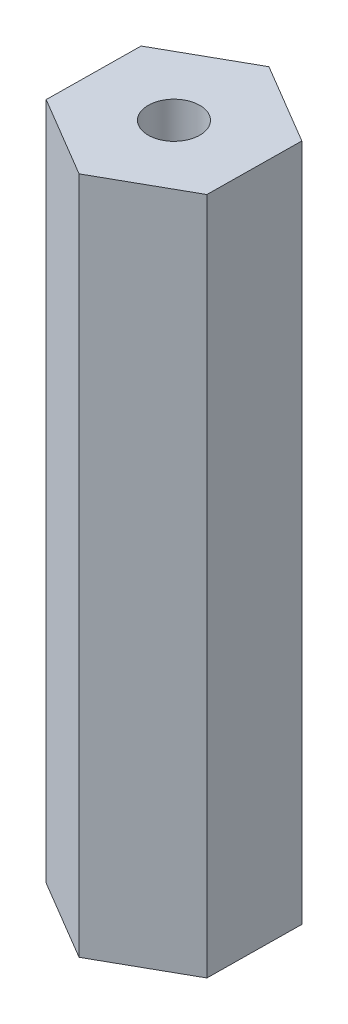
ISO-10303-21;
HEADER;
FILE_DESCRIPTION(('STEP AP214'),'2;1');
FILE_NAME('part.step','',(''),(''),'','','');
FILE_SCHEMA(('AUTOMOTIVE_DESIGN { 1 0 10303 214 1 1 1 1 }'));
ENDSEC;
DATA;
#1=APPLICATION_CONTEXT('core data for automotive mechanical design processes');
#2=APPLICATION_PROTOCOL_DEFINITION('international standard','automotive_design',2000,#1);
#3=PRODUCT_CONTEXT('',#1,'mechanical');
#4=PRODUCT('Part','Part','',(#3));
#5=PRODUCT_RELATED_PRODUCT_CATEGORY('part','',(#4));
#6=PRODUCT_DEFINITION_FORMATION('','',#4);
#7=PRODUCT_DEFINITION_CONTEXT('part definition',#1,'design');
#8=PRODUCT_DEFINITION('design','',#6,#7);
#9=PRODUCT_DEFINITION_SHAPE('','',#8);
#10=(LENGTH_UNIT() NAMED_UNIT(*) SI_UNIT(.MILLI.,.METRE.));
#11=(NAMED_UNIT(*) PLANE_ANGLE_UNIT() SI_UNIT($,.RADIAN.));
#12=(NAMED_UNIT(*) SI_UNIT($,.STERADIAN.) SOLID_ANGLE_UNIT());
#13=UNCERTAINTY_MEASURE_WITH_UNIT(LENGTH_MEASURE(1.E-05),#10,'distance_accuracy_value','');
#14=(GEOMETRIC_REPRESENTATION_CONTEXT(3) GLOBAL_UNCERTAINTY_ASSIGNED_CONTEXT((#13)) GLOBAL_UNIT_ASSIGNED_CONTEXT((#10,
#11,#12)) REPRESENTATION_CONTEXT('',''));
#15=CARTESIAN_POINT('',(0.,0.,0.));
#16=DIRECTION('',(0.,0.,1.));
#17=DIRECTION('',(1.,0.,0.));
#18=AXIS2_PLACEMENT_3D('',#15,#16,#17);
#19=CARTESIAN_POINT('',(0.,52.9971,0.));
#20=DIRECTION('',(0.,1.,0.));
#21=DIRECTION('',(0.,0.,1.));
#22=AXIS2_PLACEMENT_3D('',#19,#20,#21);
#23=PLANE('',#22);
#24=DIRECTION('',(0.87171232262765,0.,-0.490017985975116));
#25=VECTOR('',#24,1.);
#26=CARTESIAN_POINT('',(-0.0842350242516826,52.9971,7.3318645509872));
#27=LINE('',#26,#25);
#28=CARTESIAN_POINT('',(-0.0842350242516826,52.9971,7.3318645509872));
#29=VERTEX_POINT('',#28);
#30=CARTESIAN_POINT('',(6.30746344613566,52.9971,3.73888194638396));
#31=VERTEX_POINT('',#30);
#32=EDGE_CURVE('E129',#29,#31,#27,.T.);
#33=ORIENTED_EDGE('',*,*,#32,.T.);
#34=DIRECTION('',(0.0114881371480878,0.,-0.999934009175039));
#35=VECTOR('',#34,1.);
#36=CARTESIAN_POINT('',(6.30746344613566,52.9971,3.73888194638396));
#37=LINE('',#36,#35);
#38=CARTESIAN_POINT('',(6.39169847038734,52.9971,-3.59298260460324));
#39=VERTEX_POINT('',#38);
#40=EDGE_CURVE('E87',#31,#39,#37,.T.);
#41=ORIENTED_EDGE('',*,*,#40,.T.);
#42=DIRECTION('',(-0.860224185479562,0.,-0.509916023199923));
#43=VECTOR('',#42,1.);
#44=CARTESIAN_POINT('',(6.39169847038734,52.9971,-3.59298260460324));
#45=LINE('',#44,#43);
#46=CARTESIAN_POINT('',(0.0842350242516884,52.9971,-7.33186455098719));
#47=VERTEX_POINT('',#46);
#48=EDGE_CURVE('E100',#39,#47,#45,.T.);
#49=ORIENTED_EDGE('',*,*,#48,.T.);
#50=DIRECTION('',(-0.87171232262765,0.,0.490017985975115));
#51=VECTOR('',#50,1.);
#52=CARTESIAN_POINT('',(0.0842350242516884,52.9971,-7.33186455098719));
#53=LINE('',#52,#51);
#54=CARTESIAN_POINT('',(-6.30746344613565,52.9971,-3.73888194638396));
#55=VERTEX_POINT('',#54);
#56=EDGE_CURVE('E94',#47,#55,#53,.T.);
#57=ORIENTED_EDGE('',*,*,#56,.T.);
#58=DIRECTION('',(-0.011488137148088,0.,0.999934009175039));
#59=VECTOR('',#58,1.);
#60=CARTESIAN_POINT('',(-6.30746344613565,52.9971,-3.73888194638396));
#61=LINE('',#60,#59);
#62=CARTESIAN_POINT('',(-6.39169847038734,52.9971,3.59298260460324));
#63=VERTEX_POINT('',#62);
#64=EDGE_CURVE('E98',#55,#63,#61,.T.);
#65=ORIENTED_EDGE('',*,*,#64,.T.);
#66=DIRECTION('',(0.860224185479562,0.,0.509916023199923));
#67=VECTOR('',#66,1.);
#68=CARTESIAN_POINT('',(-6.39169847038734,52.9971,3.59298260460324));
#69=LINE('',#68,#67);
#70=EDGE_CURVE('E50',#63,#29,#69,.T.);
#71=ORIENTED_EDGE('',*,*,#70,.T.);
#72=EDGE_LOOP('',(#33,#41,#49,#57,#65,#71));
#73=FACE_BOUND('',#72,.T.);
#74=CARTESIAN_POINT('',(0.,52.9971,0.));
#75=DIRECTION('',(0.,1.,0.));
#76=DIRECTION('',(0.,0.,1.));
#77=AXIS2_PLACEMENT_3D('',#74,#75,#76);
#78=CIRCLE('',#77,2.0193);
#79=CARTESIAN_POINT('',(0.,52.9971,-2.0193));
#80=VERTEX_POINT('',#79);
#81=EDGE_CURVE('E122',#80,#80,#78,.T.);
#82=ORIENTED_EDGE('',*,*,#81,.F.);
#83=EDGE_LOOP('',(#82));
#84=FACE_BOUND('',#83,.T.);
#85=ADVANCED_FACE('F33',(#73,#84),#23,.T.);
#86=CARTESIAN_POINT('',(0.,0.,0.));
#87=DIRECTION('',(0.,1.,0.));
#88=DIRECTION('',(0.,0.,1.));
#89=AXIS2_PLACEMENT_3D('',#86,#87,#88);
#90=PLANE('',#89);
#91=DIRECTION('',(0.87171232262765,0.,-0.490017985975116));
#92=VECTOR('',#91,1.);
#93=CARTESIAN_POINT('',(-0.0842350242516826,0.,7.3318645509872));
#94=LINE('',#93,#92);
#95=CARTESIAN_POINT('',(-0.0842350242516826,0.,7.3318645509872));
#96=VERTEX_POINT('',#95);
#97=CARTESIAN_POINT('',(6.30746344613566,0.,3.73888194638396));
#98=VERTEX_POINT('',#97);
#99=EDGE_CURVE('E118',#96,#98,#94,.T.);
#100=ORIENTED_EDGE('',*,*,#99,.F.);
#101=DIRECTION('',(0.860224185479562,0.,0.509916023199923));
#102=VECTOR('',#101,1.);
#103=CARTESIAN_POINT('',(-6.39169847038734,0.,3.59298260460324));
#104=LINE('',#103,#102);
#105=CARTESIAN_POINT('',(-6.39169847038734,0.,3.59298260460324));
#106=VERTEX_POINT('',#105);
#107=EDGE_CURVE('E79',#106,#96,#104,.T.);
#108=ORIENTED_EDGE('',*,*,#107,.F.);
#109=DIRECTION('',(-0.011488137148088,0.,0.999934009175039));
#110=VECTOR('',#109,1.);
#111=CARTESIAN_POINT('',(-6.30746344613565,0.,-3.73888194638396));
#112=LINE('',#111,#110);
#113=CARTESIAN_POINT('',(-6.30746344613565,0.,-3.73888194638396));
#114=VERTEX_POINT('',#113);
#115=EDGE_CURVE('E73',#114,#106,#112,.T.);
#116=ORIENTED_EDGE('',*,*,#115,.F.);
#117=DIRECTION('',(-0.87171232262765,0.,0.490017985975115));
#118=VECTOR('',#117,1.);
#119=CARTESIAN_POINT('',(0.0842350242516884,0.,-7.33186455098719));
#120=LINE('',#119,#118);
#121=CARTESIAN_POINT('',(0.0842350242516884,0.,-7.33186455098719));
#122=VERTEX_POINT('',#121);
#123=EDGE_CURVE('E108',#122,#114,#120,.T.);
#124=ORIENTED_EDGE('',*,*,#123,.F.);
#125=DIRECTION('',(-0.860224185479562,0.,-0.509916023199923));
#126=VECTOR('',#125,1.);
#127=CARTESIAN_POINT('',(6.39169847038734,0.,-3.59298260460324));
#128=LINE('',#127,#126);
#129=CARTESIAN_POINT('',(6.39169847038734,0.,-3.59298260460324));
#130=VERTEX_POINT('',#129);
#131=EDGE_CURVE('E124',#130,#122,#128,.T.);
#132=ORIENTED_EDGE('',*,*,#131,.F.);
#133=DIRECTION('',(0.0114881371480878,0.,-0.999934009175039));
#134=VECTOR('',#133,1.);
#135=CARTESIAN_POINT('',(6.30746344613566,0.,3.73888194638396));
#136=LINE('',#135,#134);
#137=EDGE_CURVE('E121',#98,#130,#136,.T.);
#138=ORIENTED_EDGE('',*,*,#137,.F.);
#139=EDGE_LOOP('',(#100,#108,#116,#124,#132,#138));
#140=FACE_BOUND('',#139,.T.);
#141=CARTESIAN_POINT('',(0.,0.,0.));
#142=DIRECTION('',(0.,1.,0.));
#143=DIRECTION('',(0.,0.,1.));
#144=AXIS2_PLACEMENT_3D('',#141,#142,#143);
#145=CIRCLE('',#144,2.0193);
#146=CARTESIAN_POINT('',(0.,0.,-2.0193));
#147=VERTEX_POINT('',#146);
#148=EDGE_CURVE('E222',#147,#147,#145,.T.);
#149=ORIENTED_EDGE('',*,*,#148,.T.);
#150=EDGE_LOOP('',(#149));
#151=FACE_BOUND('',#150,.T.);
#152=ADVANCED_FACE('F138',(#140,#151),#90,.F.);
#153=CARTESIAN_POINT('',(-0.0842350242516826,52.9971,7.3318645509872));
#154=DIRECTION('',(-0.490017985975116,0.,-0.87171232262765));
#155=DIRECTION('',(-0.87171232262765,0.,0.490017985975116));
#156=AXIS2_PLACEMENT_3D('',#153,#154,#155);
#157=PLANE('',#156);
#158=ORIENTED_EDGE('',*,*,#99,.T.);
#159=DIRECTION('',(0.,-1.,0.));
#160=VECTOR('',#159,1.);
#161=CARTESIAN_POINT('',(6.30746344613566,52.9971,3.73888194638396));
#162=LINE('',#161,#160);
#163=EDGE_CURVE('E11',#31,#98,#162,.T.);
#164=ORIENTED_EDGE('',*,*,#163,.F.);
#165=ORIENTED_EDGE('',*,*,#32,.F.);
#166=DIRECTION('',(0.,-1.,0.));
#167=VECTOR('',#166,1.);
#168=CARTESIAN_POINT('',(-0.0842350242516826,52.9971,7.3318645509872));
#169=LINE('',#168,#167);
#170=EDGE_CURVE('E114',#29,#96,#169,.T.);
#171=ORIENTED_EDGE('',*,*,#170,.T.);
#172=EDGE_LOOP('',(#158,#164,#165,#171));
#173=FACE_BOUND('',#172,.T.);
#174=ADVANCED_FACE('F35',(#173),#157,.F.);
#175=CARTESIAN_POINT('',(6.30746344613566,52.9971,3.73888194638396));
#176=DIRECTION('',(-0.999934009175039,0.,-0.0114881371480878));
#177=DIRECTION('',(-0.0114881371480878,0.,0.999934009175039));
#178=AXIS2_PLACEMENT_3D('',#175,#176,#177);
#179=PLANE('',#178);
#180=ORIENTED_EDGE('',*,*,#137,.T.);
#181=DIRECTION('',(0.,-1.,0.));
#182=VECTOR('',#181,1.);
#183=CARTESIAN_POINT('',(6.39169847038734,52.9971,-3.59298260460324));
#184=LINE('',#183,#182);
#185=EDGE_CURVE('E42',#39,#130,#184,.T.);
#186=ORIENTED_EDGE('',*,*,#185,.F.);
#187=ORIENTED_EDGE('',*,*,#40,.F.);
#188=ORIENTED_EDGE('',*,*,#163,.T.);
#189=EDGE_LOOP('',(#180,#186,#187,#188));
#190=FACE_BOUND('',#189,.T.);
#191=ADVANCED_FACE('F163',(#190),#179,.F.);
#192=CARTESIAN_POINT('',(6.39169847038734,52.9971,-3.59298260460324));
#193=DIRECTION('',(-0.509916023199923,0.,0.860224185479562));
#194=DIRECTION('',(0.860224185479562,0.,0.509916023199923));
#195=AXIS2_PLACEMENT_3D('',#192,#193,#194);
#196=PLANE('',#195);
#197=ORIENTED_EDGE('',*,*,#131,.T.);
#198=DIRECTION('',(0.,-1.,0.));
#199=VECTOR('',#198,1.);
#200=CARTESIAN_POINT('',(0.0842350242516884,52.9971,-7.33186455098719));
#201=LINE('',#200,#199);
#202=EDGE_CURVE('E109',#47,#122,#201,.T.);
#203=ORIENTED_EDGE('',*,*,#202,.F.);
#204=ORIENTED_EDGE('',*,*,#48,.F.);
#205=ORIENTED_EDGE('',*,*,#185,.T.);
#206=EDGE_LOOP('',(#197,#203,#204,#205));
#207=FACE_BOUND('',#206,.T.);
#208=ADVANCED_FACE('F135',(#207),#196,.F.);
#209=CARTESIAN_POINT('',(0.0842350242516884,52.9971,-7.33186455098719));
#210=DIRECTION('',(0.490017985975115,0.,0.87171232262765));
#211=DIRECTION('',(0.87171232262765,0.,-0.490017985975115));
#212=AXIS2_PLACEMENT_3D('',#209,#210,#211);
#213=PLANE('',#212);
#214=ORIENTED_EDGE('',*,*,#123,.T.);
#215=DIRECTION('',(0.,-1.,0.));
#216=VECTOR('',#215,1.);
#217=CARTESIAN_POINT('',(-6.30746344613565,52.9971,-3.73888194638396));
#218=LINE('',#217,#216);
#219=EDGE_CURVE('E105',#55,#114,#218,.T.);
#220=ORIENTED_EDGE('',*,*,#219,.F.);
#221=ORIENTED_EDGE('',*,*,#56,.F.);
#222=ORIENTED_EDGE('',*,*,#202,.T.);
#223=EDGE_LOOP('',(#214,#220,#221,#222));
#224=FACE_BOUND('',#223,.T.);
#225=ADVANCED_FACE('F106',(#224),#213,.F.);
#226=CARTESIAN_POINT('',(-6.30746344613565,52.9971,-3.73888194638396));
#227=DIRECTION('',(0.999934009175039,0.,0.011488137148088));
#228=DIRECTION('',(0.011488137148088,0.,-0.999934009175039));
#229=AXIS2_PLACEMENT_3D('',#226,#227,#228);
#230=PLANE('',#229);
#231=ORIENTED_EDGE('',*,*,#115,.T.);
#232=DIRECTION('',(0.,-1.,0.));
#233=VECTOR('',#232,1.);
#234=CARTESIAN_POINT('',(-6.39169847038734,52.9971,3.59298260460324));
#235=LINE('',#234,#233);
#236=EDGE_CURVE('E110',#63,#106,#235,.T.);
#237=ORIENTED_EDGE('',*,*,#236,.F.);
#238=ORIENTED_EDGE('',*,*,#64,.F.);
#239=ORIENTED_EDGE('',*,*,#219,.T.);
#240=EDGE_LOOP('',(#231,#237,#238,#239));
#241=FACE_BOUND('',#240,.T.);
#242=ADVANCED_FACE('F112',(#241),#230,.F.);
#243=CARTESIAN_POINT('',(-6.39169847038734,52.9971,3.59298260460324));
#244=DIRECTION('',(0.509916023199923,0.,-0.860224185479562));
#245=DIRECTION('',(-0.860224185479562,0.,-0.509916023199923));
#246=AXIS2_PLACEMENT_3D('',#243,#244,#245);
#247=PLANE('',#246);
#248=ORIENTED_EDGE('',*,*,#107,.T.);
#249=ORIENTED_EDGE('',*,*,#170,.F.);
#250=ORIENTED_EDGE('',*,*,#70,.F.);
#251=ORIENTED_EDGE('',*,*,#236,.T.);
#252=EDGE_LOOP('',(#248,#249,#250,#251));
#253=FACE_BOUND('',#252,.T.);
#254=ADVANCED_FACE('F143',(#253),#247,.F.);
#255=CARTESIAN_POINT('',(0.,52.9971,0.));
#256=DIRECTION('',(0.,-1.,0.));
#257=DIRECTION('',(0.,0.,-1.));
#258=AXIS2_PLACEMENT_3D('',#255,#256,#257);
#259=CYLINDRICAL_SURFACE('',#258,2.0193);
#260=CARTESIAN_POINT('',(0.,52.9971,-2.0193));
#261=CARTESIAN_POINT('',(0.,52.445046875,-2.0193));
#262=CARTESIAN_POINT('',(0.,51.89299375,-2.0193));
#263=CARTESIAN_POINT('',(0.,50.7888875,-2.0193));
#264=CARTESIAN_POINT('',(0.,50.236834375,-2.0193));
#265=CARTESIAN_POINT('',(0.,49.132728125,-2.0193));
#266=CARTESIAN_POINT('',(0.,48.580675,-2.0193));
#267=CARTESIAN_POINT('',(0.,47.47656875,-2.0193));
#268=CARTESIAN_POINT('',(0.,46.924515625,-2.0193));
#269=CARTESIAN_POINT('',(0.,45.820409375,-2.0193));
#270=CARTESIAN_POINT('',(0.,45.26835625,-2.0193));
#271=CARTESIAN_POINT('',(0.,44.16425,-2.0193));
#272=CARTESIAN_POINT('',(0.,43.612196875,-2.0193));
#273=CARTESIAN_POINT('',(0.,42.508090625,-2.0193));
#274=CARTESIAN_POINT('',(0.,41.9560375,-2.0193));
#275=CARTESIAN_POINT('',(0.,40.85193125,-2.0193));
#276=CARTESIAN_POINT('',(0.,40.299878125,-2.0193));
#277=CARTESIAN_POINT('',(0.,39.195771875,-2.0193));
#278=CARTESIAN_POINT('',(0.,38.64371875,-2.0193));
#279=CARTESIAN_POINT('',(0.,37.5396125,-2.0193));
#280=CARTESIAN_POINT('',(0.,36.987559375,-2.0193));
#281=CARTESIAN_POINT('',(0.,35.883453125,-2.0193));
#282=CARTESIAN_POINT('',(0.,35.3314,-2.0193));
#283=CARTESIAN_POINT('',(0.,34.22729375,-2.0193));
#284=CARTESIAN_POINT('',(0.,33.675240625,-2.0193));
#285=CARTESIAN_POINT('',(0.,32.571134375,-2.0193));
#286=CARTESIAN_POINT('',(0.,32.01908125,-2.0193));
#287=CARTESIAN_POINT('',(0.,30.914975,-2.0193));
#288=CARTESIAN_POINT('',(0.,30.362921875,-2.0193));
#289=CARTESIAN_POINT('',(0.,29.258815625,-2.0193));
#290=CARTESIAN_POINT('',(0.,28.7067625,-2.0193));
#291=CARTESIAN_POINT('',(0.,27.60265625,-2.0193));
#292=CARTESIAN_POINT('',(0.,27.050603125,-2.0193));
#293=CARTESIAN_POINT('',(0.,25.946496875,-2.0193));
#294=CARTESIAN_POINT('',(0.,25.39444375,-2.0193));
#295=CARTESIAN_POINT('',(0.,24.2903375,-2.0193));
#296=CARTESIAN_POINT('',(0.,23.738284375,-2.0193));
#297=CARTESIAN_POINT('',(0.,22.634178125,-2.0193));
#298=CARTESIAN_POINT('',(0.,22.082125,-2.0193));
#299=CARTESIAN_POINT('',(0.,20.97801875,-2.0193));
#300=CARTESIAN_POINT('',(0.,20.425965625,-2.0193));
#301=CARTESIAN_POINT('',(0.,19.321859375,-2.0193));
#302=CARTESIAN_POINT('',(0.,18.76980625,-2.0193));
#303=CARTESIAN_POINT('',(0.,17.6657,-2.0193));
#304=CARTESIAN_POINT('',(0.,17.113646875,-2.0193));
#305=CARTESIAN_POINT('',(0.,16.009540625,-2.0193));
#306=CARTESIAN_POINT('',(0.,15.4574875,-2.0193));
#307=CARTESIAN_POINT('',(0.,14.35338125,-2.0193));
#308=CARTESIAN_POINT('',(0.,13.801328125,-2.0193));
#309=CARTESIAN_POINT('',(0.,12.697221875,-2.0193));
#310=CARTESIAN_POINT('',(0.,12.14516875,-2.0193));
#311=CARTESIAN_POINT('',(0.,11.0410625,-2.0193));
#312=CARTESIAN_POINT('',(0.,10.489009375,-2.0193));
#313=CARTESIAN_POINT('',(0.,9.384903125,-2.0193));
#314=CARTESIAN_POINT('',(0.,8.83285,-2.0193));
#315=CARTESIAN_POINT('',(0.,7.72874375,-2.0193));
#316=CARTESIAN_POINT('',(0.,7.176690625,-2.0193));
#317=CARTESIAN_POINT('',(0.,6.072584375,-2.0193));
#318=CARTESIAN_POINT('',(0.,5.52053125,-2.0193));
#319=CARTESIAN_POINT('',(0.,4.416425,-2.0193));
#320=CARTESIAN_POINT('',(0.,3.864371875,-2.0193));
#321=CARTESIAN_POINT('',(0.,2.760265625,-2.0193));
#322=CARTESIAN_POINT('',(0.,2.2082125,-2.0193));
#323=CARTESIAN_POINT('',(0.,1.10410625,-2.0193));
#324=CARTESIAN_POINT('',(0.,0.552053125,-2.0193));
#325=CARTESIAN_POINT('',(0.,0.,-2.0193));
#326=B_SPLINE_CURVE_WITH_KNOTS('',3,(#260,#261,#262,#263,#264,#265,#266,#267,#268,#269,#270,
#271,#272,#273,#274,#275,#276,#277,#278,#279,#280,#281,#282,#283,#284,#285,#286,#287,#288,#289,
#290,#291,#292,#293,#294,#295,#296,#297,#298,#299,#300,#301,#302,#303,#304,#305,#306,#307,#308,
#309,#310,#311,#312,#313,#314,#315,#316,#317,#318,#319,#320,#321,#322,#323,#324,#325),
.UNSPECIFIED.,.F.,.F.,(4,2,2,2,2,2,2,2,2,2,2,2,2,2,2,2,2,2,2,2,2,2,2,2,2,2,2,2,2,2,2,2,4),(0.,
1.656159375,3.31231875,4.968478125,6.6246375,8.280796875,9.93695625,11.593115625,13.249275,
14.905434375,16.56159375,18.217753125,19.8739125,21.530071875,23.18623125,24.842390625,26.49855,
28.154709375,29.81086875,31.467028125,33.1231875,34.779346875,36.43550625,38.091665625,
39.747825,41.403984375,43.06014375,44.716303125,46.3724625,48.028621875,49.68478125,
51.340940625,52.9971),.UNSPECIFIED.);
#327=EDGE_CURVE('BSEAM145',#80,#147,#326,.T.);
#328=ORIENTED_EDGE('',*,*,#81,.T.);
#329=ORIENTED_EDGE('',*,*,#148,.F.);
#330=ORIENTED_EDGE('',*,*,#327,.T.);
#331=ORIENTED_EDGE('',*,*,#327,.F.);
#332=EDGE_LOOP('',(#328,#330,#329,#331));
#333=FACE_BOUND('',#332,.T.);
#334=ADVANCED_FACE('F145',(#333),#259,.F.);
#335=CLOSED_SHELL('',(#85,#152,#174,#191,#208,#225,#242,#254,#334));
#336=MANIFOLD_SOLID_BREP('B2',#335);
#337=ADVANCED_BREP_SHAPE_REPRESENTATION('',(#18,#336),#14);
#338=SHAPE_DEFINITION_REPRESENTATION(#9,#337);
ENDSEC;
END-ISO-10303-21;
